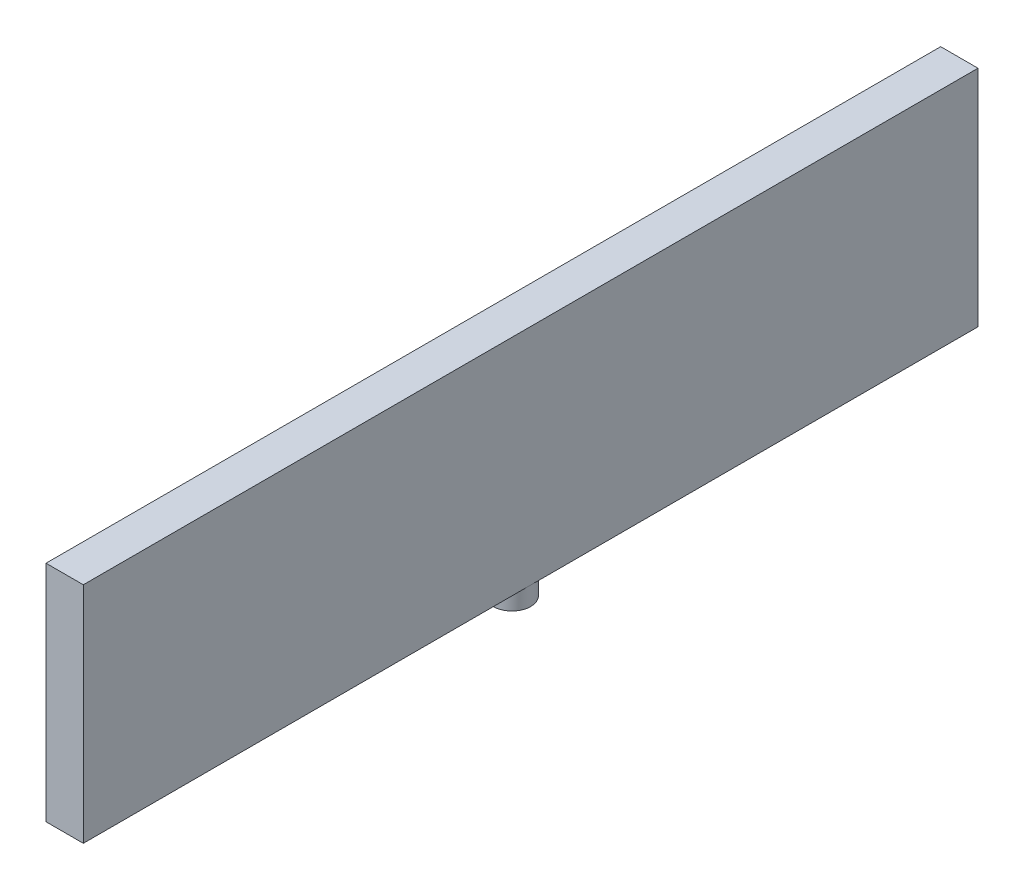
from build123d import *

# Parameters (mm, degrees)
SKETCH1_W      = 12.7
SKETCH1_H      = 76.2
EXTRUDE1_DEPTH = 304.426146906
SKETCH2_R      = 6.35
EXTRUDE2_DEPTH = 6.35


with BuildPart() as part:
    # Sketch1 → Extrude1 (new body)
    with BuildSketch(Plane.XY):
        with Locations((-168.982936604, 161.287086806)):
            Rectangle(SKETCH1_W, SKETCH1_H)
    extrude(amount=-EXTRUDE1_DEPTH)

    # Sketch2 → Extrude2 (add)
    with BuildSketch(Plane.XZ.offset(-123.187086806)):
        with Locations(Location((-168.982936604, -152.213073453, 0), (0, 0, 180))):
            Circle(SKETCH2_R)
    extrude(amount=EXTRUDE2_DEPTH)


solid = part.part
